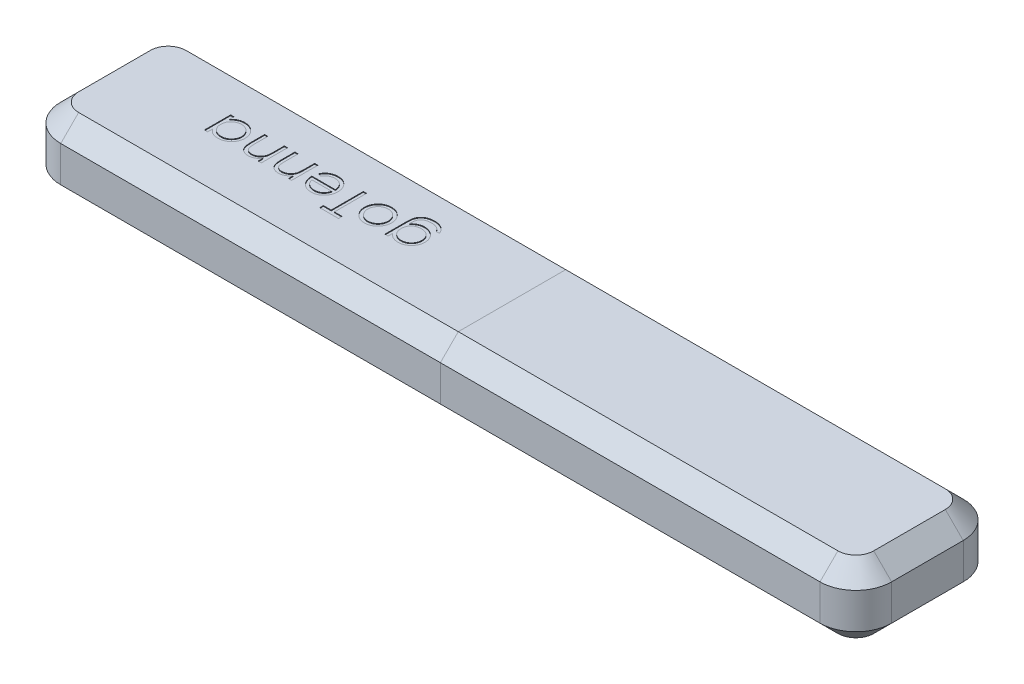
from build123d import *

# Parameters (mm, degrees)
SKETCH1_W           = 25.4
SKETCH1_H           = 12.7
BOSS_EXTRUDE1_DEPTH = 73.66
SKETCH2_W           = 25.4
SKETCH2_H           = 12.7
BOSS_EXTRUDE2_DEPTH = 73.66
FILLET1_R           = 6.35
FILLET2_R           = 6.35
CHAMFER1_SIZE       = 3.175
CHAMFER2_SIZE       = 3.175
CUT_EXTRUDE1_DEPTH  = 0.127


with BuildPart() as part:
    # Sketch1 → Boss-Extrude1 (new body)
    with BuildSketch(Plane(origin=(0, 0, 0), x_dir=(0, 0, -1), z_dir=(1, 0, 0))):
        Rectangle(SKETCH1_W, SKETCH1_H)
    extrude(amount=BOSS_EXTRUDE1_DEPTH)

    # Fillet2
    fillet2_edges = [part.edges().sort_by_distance(p)[0] for p in [
        (73.66, 0, -12.7),
        (73.66, 0, 12.7),
    ]]
    fillet(fillet2_edges, radius=FILLET2_R)

    # Chamfer2
    chamfer2_edges = [part.edges().sort_by_distance(p)[0] for p in [
        (73.66, -6.35, 0),
        (73.66, 6.35, 0),
        (33.655, 6.35, 12.7),
        (33.655, 6.35, -12.7),
        (71.800128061, 6.35, 10.840128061),
        (71.800128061, 6.35, -10.840128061),
        (33.655, -6.35, -12.7),
        (33.655, -6.35, 12.7),
        (71.800128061, -6.35, 10.840128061),
        (71.800128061, -6.35, -10.840128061),
    ]]
    chamfer(chamfer2_edges, length=CHAMFER2_SIZE)


with BuildPart() as body_2:
    # Sketch2 → Boss-Extrude2 (new body)
    with BuildSketch(Plane.ZY):
        Rectangle(SKETCH2_W, SKETCH2_H)
    extrude(amount=BOSS_EXTRUDE2_DEPTH)

    # Fillet1
    fillet1_edges = [body_2.edges().sort_by_distance(p)[0] for p in [
        (-73.66, 0, -12.7),
        (-73.66, 0, 12.7),
    ]]
    fillet(fillet1_edges, radius=FILLET1_R)

    # Chamfer1
    chamfer1_edges = [body_2.edges().sort_by_distance(p)[0] for p in [
        (-73.66, -6.35, 0),
        (-73.66, 6.35, 0),
        (-33.655, -6.35, 12.7),
        (-33.655, -6.35, -12.7),
        (-71.800128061, -6.35, 10.840128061),
        (-71.800128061, -6.35, -10.840128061),
        (-33.655, 6.35, -12.7),
        (-33.655, 6.35, 12.7),
        (-71.800128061, 6.35, 10.840128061),
        (-71.800128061, 6.35, -10.840128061),
    ]]
    chamfer(chamfer1_edges, length=CHAMFER1_SIZE)

    # Sketch3 → Cut-Extrude1 (cut)
    # profile 1 of 7: a face of its own
    with BuildSketch(Plane(origin=(0, 6.35, 0), x_dir=(1, 0, 0), z_dir=(0, 1, 0))):
        with BuildLine():
            Line((-20.904662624, -1.06099568), (-21.474534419, -1.06099568))
            Line((-21.474534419, -1.06099568), (-21.474534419, 2.621546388))
            add(Edge.make_bspline(
                [(-21.474534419, 2.621546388), (-21.474031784, 2.699991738), (-21.473061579, 2.85141016), (-21.466074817, 3.070355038), (-21.451341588, 3.272586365), (-21.434634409, 3.459026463), (-21.410601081, 3.628811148), (-21.381252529, 3.782447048), (-21.348167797, 3.920081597), (-21.319102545, 4.004853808), (-21.30535373, 4.044953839)],
                knots=[0, 0, 0, 0, 1.307562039, 2.523909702, 3.650326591, 4.686913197, 5.643429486, 6.506965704, 7.293745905, 8, 8, 8, 8], degree=3))
            add(Edge.make_bspline(
                [(-21.30535373, 4.044953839), (-21.285055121, 4.097079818), (-21.24506482, 4.199773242), (-21.170134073, 4.345316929), (-21.086351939, 4.482469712), (-20.990347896, 4.609703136), (-20.884435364, 4.728874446), (-20.767298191, 4.838264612), (-20.639222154, 4.937736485), (-20.501354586, 5.028233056), (-20.354676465, 5.10910295), (-20.199990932, 5.179590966), (-20.037685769, 5.237882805), (-19.868478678, 5.285947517), (-19.692295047, 5.324696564), (-19.508571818, 5.350557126), (-19.317923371, 5.367968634), (-19.188303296, 5.369591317), (-19.12254123, 5.370414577)],
                knots=[0, 0, 0, 0, 0.981980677, 1.934600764, 2.870922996, 3.801898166, 4.730277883, 5.66822786, 6.612778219, 7.575390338, 8.562104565, 9.552017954, 10.558022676, 11.588218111, 12.640020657, 13.7238485, 14.84520645, 16, 16, 16, 16], degree=3))
            add(Edge.make_bspline(
                [(-19.12254123, 5.370414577), (-19.026619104, 5.368669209), (-18.83930761, 5.365260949), (-18.565671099, 5.332571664), (-18.306977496, 5.280171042), (-18.064966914, 5.204734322), (-17.841480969, 5.111846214), (-17.637244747, 5.006282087), (-17.455666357, 4.883959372), (-17.292128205, 4.745219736), (-17.14455914, 4.580170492), (-17.00571441, 4.385685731), (-16.872073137, 4.158777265), (-16.793752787, 3.992239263), (-16.752739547, 3.905029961)],
                knots=[0, 0, 0, 0, 1.157891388, 2.261067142, 3.322482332, 4.341146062, 5.316743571, 6.242014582, 7.11254001, 7.955027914, 8.825041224, 9.77858257, 10.836732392, 12, 12, 12, 12], degree=3))
            Line((-16.752739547, 3.905029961), (-17.322611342, 3.905029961))
            add(Edge.make_bspline(
                [(-17.322611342, 3.905029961), (-17.368464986, 3.977770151), (-17.458103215, 4.119968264), (-17.625173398, 4.304266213), (-17.809613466, 4.460323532), (-18.015336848, 4.586946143), (-18.243778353, 4.684424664), (-18.496415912, 4.752132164), (-18.773940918, 4.793094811), (-18.967204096, 4.797992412), (-19.067843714, 4.800542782)],
                knots=[0, 0, 0, 0, 0.997887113, 1.950746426, 2.877762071, 3.798308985, 4.747694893, 5.754452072, 6.830656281, 8, 8, 8, 8], degree=3))
            add(Edge.make_bspline(
                [(-19.067843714, 4.800542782), (-19.167213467, 4.797970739), (-19.358788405, 4.793012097), (-19.634565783, 4.751932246), (-19.886881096, 4.684592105), (-20.112507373, 4.587500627), (-20.309293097, 4.469931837), (-20.480505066, 4.341160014), (-20.618182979, 4.193692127), (-20.711167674, 4.058102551), (-20.768908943, 3.93721438), (-20.805714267, 3.833167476), (-20.835397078, 3.715889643), (-20.860877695, 3.585101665), (-20.881068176, 3.440753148), (-20.894315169, 3.282351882), (-20.903717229, 3.110969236), (-20.904340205, 2.992146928), (-20.904662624, 2.930650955)],
                knots=[0, 0, 0, 0, 1.570812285, 3.028368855, 4.398074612, 5.689726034, 6.898366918, 8.016954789, 9.065347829, 10.075205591, 10.603066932, 11.179971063, 11.817519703, 12.514501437, 13.286417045, 14.121160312, 15.027614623, 16, 16, 16, 16], degree=3))
            Line((-20.904662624, 2.930650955), (-20.904662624, 2.690236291))
            add(Edge.make_bspline(
                [(-20.904662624, 2.690236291), (-20.846801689, 2.759045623), (-20.732097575, 2.895453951), (-20.534540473, 3.074517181), (-20.317396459, 3.226871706), (-20.083734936, 3.353600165), (-19.837038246, 3.454005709), (-19.581668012, 3.526758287), (-19.318341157, 3.571884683), (-19.140104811, 3.576869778), (-19.05003522, 3.579388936)],
                knots=[0, 0, 0, 0, 1.012670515, 2.007528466, 2.995541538, 3.996581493, 4.997861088, 5.991949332, 6.98525577, 8, 8, 8, 8], degree=3))
            add(Edge.make_bspline(
                [(-19.05003522, 3.579388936), (-18.997012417, 3.578269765), (-18.891633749, 3.5760455), (-18.73463675, 3.562515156), (-18.580665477, 3.536167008), (-18.428739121, 3.502428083), (-18.279919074, 3.457201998), (-18.132422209, 3.404121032), (-17.988390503, 3.338923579), (-17.847089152, 3.265520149), (-17.71184219, 3.183046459), (-17.583076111, 3.093939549), (-17.461578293, 2.998392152), (-17.348491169, 2.895524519), (-17.243909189, 2.785504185), (-17.146654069, 2.669369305), (-17.057605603, 2.546204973), (-16.977917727, 2.41596361), (-16.905114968, 2.281820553), (-16.842782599, 2.143133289), (-16.791038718, 2.000779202), (-16.745436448, 1.856537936), (-16.713144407, 1.707779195), (-16.688452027, 1.556266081), (-16.674598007, 1.401074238), (-16.672423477, 1.296534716), (-16.671329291, 1.243932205)],
                knots=[0, 0, 0, 0, 1.028752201, 2.044564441, 3.053391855, 4.057142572, 5.061701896, 6.068783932, 7.096088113, 8.1262863, 9.156123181, 10.166960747, 11.162589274, 12.152492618, 13.129945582, 14.10521553, 15.089188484, 16.075359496, 17.065365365, 18.04840954, 19.021769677, 20.00271226, 20.980580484, 21.971849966, 22.979469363, 24, 24, 24, 24], degree=3))
            add(Edge.make_bspline(
                [(-16.671329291, 1.243932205), (-16.672270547, 1.19131205), (-16.674149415, 1.086275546), (-16.690398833, 0.930469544), (-16.713527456, 0.77673218), (-16.750325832, 0.626731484), (-16.793989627, 0.478301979), (-16.850619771, 0.333860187), (-16.91586492, 0.191494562), (-16.990437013, 0.052453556), (-17.07391249, -0.081983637), (-17.165796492, -0.209063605), (-17.264168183, -0.329843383), (-17.371007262, -0.442773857), (-17.485682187, -0.548701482), (-17.608526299, -0.646696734), (-17.73817327, -0.738530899), (-17.87506715, -0.82218844), (-18.017084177, -0.896179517), (-18.160619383, -0.963693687), (-18.307573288, -1.017277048), (-18.455206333, -1.064490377), (-18.606118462, -1.09793709), (-18.758459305, -1.1237403), (-18.912750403, -1.139460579), (-19.016079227, -1.141422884), (-19.067843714, -1.142405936)],
                knots=[0, 0, 0, 0, 1.008914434, 2.013921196, 3.001938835, 3.98818112, 4.973517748, 5.967241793, 6.960633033, 7.975722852, 8.991170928, 9.993245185, 10.981396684, 11.976616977, 12.972235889, 13.973022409, 14.988340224, 16.01763096, 17.047082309, 18.058647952, 19.057085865, 20.044802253, 21.029198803, 22.0185208, 23.007341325, 24, 24, 24, 24], degree=3))
            add(Edge.make_bspline(
                [(-19.067843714, -1.142405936), (-19.153214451, -1.139982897), (-19.321375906, -1.135210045), (-19.569343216, -1.096597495), (-19.808879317, -1.03641558), (-20.041211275, -0.948929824), (-20.267757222, -0.830537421), (-20.487153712, -0.672587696), (-20.703156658, -0.478200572), (-20.835783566, -0.327633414), (-20.904662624, -0.249437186)],
                knots=[0, 0, 0, 0, 0.967343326, 1.905452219, 2.838102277, 3.762990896, 4.713322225, 5.726933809, 6.819495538, 8, 8, 8, 8], degree=3))
            Line((-20.904662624, -0.249437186), (-20.904662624, -1.06099568))
        make_face()
        with BuildLine():
            add(Edge.make_bspline(
                [(-19.113636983, -0.572534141), (-19.030310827, -0.569691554), (-18.865342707, -0.564063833), (-18.623442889, -0.516345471), (-18.390449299, -0.440819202), (-18.168671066, -0.335688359), (-17.963173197, -0.202847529), (-17.779393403, -0.0447084), (-17.618861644, 0.13596092), (-17.484712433, 0.338545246), (-17.376539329, 0.556441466), (-17.298924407, 0.785727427), (-17.249347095, 1.023443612), (-17.243933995, 1.185175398), (-17.241201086, 1.266828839)],
                knots=[0, 0, 0, 0, 1.026297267, 2.031850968, 3.02682269, 4.039104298, 5.04807494, 6.033889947, 7.01870694, 8.017446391, 9.02017099, 10.008531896, 10.994568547, 12, 12, 12, 12], degree=3))
            add(Edge.make_bspline(
                [(-17.241201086, 1.266828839), (-17.242522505, 1.328391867), (-17.24512135, 1.44946834), (-17.269952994, 1.627178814), (-17.310532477, 1.796721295), (-17.366753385, 1.957821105), (-17.438126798, 2.111115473), (-17.528273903, 2.254812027), (-17.632626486, 2.391497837), (-17.752224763, 2.518222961), (-17.883835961, 2.633804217), (-18.026489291, 2.73483485), (-18.179411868, 2.818601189), (-18.34015796, 2.889923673), (-18.512131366, 2.942391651), (-18.692753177, 2.982355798), (-18.883234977, 3.005237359), (-19.013086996, 3.008071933), (-19.079292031, 3.009517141)],
                knots=[0, 0, 0, 0, 1.039874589, 2.045129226, 3.025325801, 3.981633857, 4.924015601, 5.876477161, 6.842427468, 7.825840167, 8.816042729, 9.798123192, 10.773172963, 11.758281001, 12.764505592, 13.805958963, 14.88136847, 16, 16, 16, 16], degree=3))
            add(Edge.make_bspline(
                [(-19.079292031, 3.009517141), (-19.14635485, 3.008124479), (-19.277495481, 3.005401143), (-19.469031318, 2.981990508), (-19.650519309, 2.944213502), (-19.821792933, 2.890577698), (-19.983499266, 2.822139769), (-20.133820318, 2.735531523), (-20.275984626, 2.636900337), (-20.405433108, 2.52184749), (-20.522544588, 2.395075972), (-20.624393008, 2.257035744), (-20.711864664, 2.110390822), (-20.781483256, 1.953271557), (-20.838910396, 1.787754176), (-20.875114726, 1.611047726), (-20.901080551, 1.425753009), (-20.903450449, 1.298727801), (-20.904662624, 1.233755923)],
                knots=[0, 0, 0, 0, 1.121992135, 2.194043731, 3.223932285, 4.220423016, 5.193184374, 6.156086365, 7.118779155, 8.084057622, 9.048292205, 10.002025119, 10.950065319, 11.899697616, 12.87359713, 13.875731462, 14.913461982, 16, 16, 16, 16], degree=3))
            add(Edge.make_bspline(
                [(-20.904662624, 1.233755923), (-20.902227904, 1.149179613), (-20.897471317, 0.983947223), (-20.852724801, 0.743154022), (-20.780138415, 0.516515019), (-20.679400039, 0.304610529), (-20.552582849, 0.110390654), (-20.398339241, -0.061221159), (-20.223500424, -0.214977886), (-20.023767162, -0.341343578), (-19.809691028, -0.444741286), (-19.584806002, -0.518795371), (-19.351570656, -0.56340556), (-19.193544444, -0.569468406), (-19.113636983, -0.572534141)],
                knots=[0, 0, 0, 0, 1.070694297, 2.091760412, 3.090724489, 4.078342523, 5.055782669, 6.018541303, 6.993409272, 7.996294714, 9.003086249, 9.99860646, 10.987976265, 12, 12, 12, 12], degree=3))
        make_face(mode=Mode.SUBTRACT)
    # profile 2 of 7: a face of its own
    with BuildSketch(Plane(origin=(0, 6.35, 0), x_dir=(1, 0, 0), z_dir=(0, 1, 0))):
        with BuildLine():
            add(Edge.make_bspline(
                [(-25.018424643, -1.142405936), (-25.105496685, -1.140557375), (-25.276223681, -1.136932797), (-25.526215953, -1.098002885), (-25.764601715, -1.03896816), (-25.992403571, -0.955869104), (-26.20773714, -0.846839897), (-26.412524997, -0.714991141), (-26.606356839, -0.559430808), (-26.722508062, -0.439028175), (-26.781465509, -0.377912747)],
                knots=[0, 0, 0, 0, 1.054042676, 2.066720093, 3.05716247, 4.025731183, 4.997454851, 5.974904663, 6.97207755, 8, 8, 8, 8], degree=3))
            add(Edge.make_bspline(
                [(-26.781465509, -0.377912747), (-26.832232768, -0.319467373), (-26.932784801, -0.203707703), (-27.061718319, -0.016009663), (-27.172791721, 0.178373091), (-27.26180595, 0.382021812), (-27.331991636, 0.593158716), (-27.381822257, 0.812509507), (-27.411462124, 1.039589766), (-27.415458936, 1.193811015), (-27.417483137, 1.27191698)],
                knots=[0, 0, 0, 0, 1.025258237, 2.030674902, 3.01204498, 3.988269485, 4.97094183, 5.956517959, 6.965070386, 8, 8, 8, 8], degree=3))
            add(Edge.make_bspline(
                [(-27.417483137, 1.27191698), (-27.415702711, 1.350475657), (-27.412184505, 1.505711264), (-27.378903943, 1.734346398), (-27.327140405, 1.956042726), (-27.253059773, 2.169872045), (-27.158067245, 2.376488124), (-27.042151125, 2.574987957), (-26.904498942, 2.765765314), (-26.748460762, 2.947192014), (-26.576018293, 3.114427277), (-26.388904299, 3.260095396), (-26.190660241, 3.385419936), (-25.978579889, 3.484962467), (-25.755682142, 3.56520068), (-25.520549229, 3.620530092), (-25.273390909, 3.654282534), (-25.104608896, 3.658596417), (-25.018424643, 3.660799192)],
                knots=[0, 0, 0, 0, 0.998669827, 1.973418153, 2.932281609, 3.89081133, 4.846438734, 5.82045571, 6.809776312, 7.834649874, 8.860672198, 9.859676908, 10.845817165, 11.837296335, 12.833502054, 13.853824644, 14.904110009, 16, 16, 16, 16], degree=3))
            add(Edge.make_bspline(
                [(-25.018424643, 3.660799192), (-24.931822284, 3.658578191), (-24.762207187, 3.65422825), (-24.514118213, 3.620781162), (-24.277995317, 3.564609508), (-24.054043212, 3.485955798), (-23.84196372, 3.384602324), (-23.642987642, 3.260583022), (-23.45578539, 3.114353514), (-23.283288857, 2.947212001), (-23.127265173, 2.765760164), (-22.989609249, 2.574989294), (-22.873694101, 2.376487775), (-22.778701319, 2.169872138), (-22.704620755, 1.956042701), (-22.652857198, 1.734346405), (-22.619576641, 1.505711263), (-22.616058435, 1.350475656), (-22.614278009, 1.27191698)],
                knots=[0, 0, 0, 0, 1.099861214, 2.154133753, 3.1731438, 4.178222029, 5.163564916, 6.153006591, 7.15072618, 8.175428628, 9.198983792, 10.187031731, 11.15979573, 12.114193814, 13.071490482, 14.029120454, 15.002614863, 16, 16, 16, 16], degree=3))
            add(Edge.make_bspline(
                [(-22.614278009, 1.27191698), (-22.616311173, 1.1942338), (-22.620336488, 1.040434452), (-22.650016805, 0.813806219), (-22.69930523, 0.595126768), (-22.77046389, 0.385142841), (-22.859312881, 0.181983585), (-22.969268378, -0.013111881), (-23.099449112, -0.19998976), (-23.199610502, -0.315595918), (-23.250295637, -0.374096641)],
                knots=[0, 0, 0, 0, 1.031377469, 2.041950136, 3.029500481, 4.003457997, 4.981637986, 5.969878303, 6.97268806, 8, 8, 8, 8], degree=3))
            add(Edge.make_bspline(
                [(-23.250295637, -0.374096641), (-23.309169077, -0.435731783), (-23.424954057, -0.556948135), (-23.619680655, -0.71220154), (-23.823587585, -0.845827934), (-24.04031013, -0.95480227), (-24.268745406, -1.038817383), (-24.508902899, -1.098278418), (-24.759805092, -1.136760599), (-24.931359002, -1.140505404), (-25.018424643, -1.142405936)],
                knots=[0, 0, 0, 0, 1.027951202, 2.021646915, 2.998468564, 3.9668038, 4.943370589, 5.93035926, 6.949632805, 8, 8, 8, 8], degree=3))
        make_face()
        with BuildLine():
            add(Edge.make_bspline(
                [(-25.015880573, -0.572534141), (-24.954308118, -0.570784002), (-24.832752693, -0.567328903), (-24.653827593, -0.541052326), (-24.481582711, -0.499413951), (-24.315669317, -0.44027948), (-24.156728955, -0.363829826), (-24.004587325, -0.27045972), (-23.859650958, -0.159672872), (-23.723041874, -0.033667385), (-23.596171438, 0.103184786), (-23.486635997, 0.250385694), (-23.392797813, 0.403845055), (-23.316124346, 0.564430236), (-23.257300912, 0.732582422), (-23.215622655, 0.907339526), (-23.18929621, 1.089221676), (-23.185883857, 1.212889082), (-23.184149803, 1.275733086)],
                knots=[0, 0, 0, 0, 1.021608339, 2.016844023, 2.99486249, 3.958675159, 4.934437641, 5.916902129, 6.916234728, 7.957219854, 8.998204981, 10.008773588, 10.997243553, 11.979355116, 12.956436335, 13.948132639, 14.957303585, 16, 16, 16, 16], degree=3))
            add(Edge.make_bspline(
                [(-23.184149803, 1.275733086), (-23.187057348, 1.356929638), (-23.19282828, 1.518089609), (-23.239995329, 1.7553656), (-23.318341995, 1.983585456), (-23.426376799, 2.200001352), (-23.559424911, 2.400584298), (-23.714997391, 2.580949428), (-23.895245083, 2.734141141), (-24.094030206, 2.86297795), (-24.308535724, 2.964436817), (-24.535165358, 3.037196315), (-24.771855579, 3.083857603), (-24.933827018, 3.088550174), (-25.015880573, 3.090927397)],
                knots=[0, 0, 0, 0, 1.016977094, 2.018509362, 3.018404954, 4.033172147, 5.041280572, 6.028085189, 7.007940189, 7.995502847, 8.989109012, 9.972200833, 10.97273166, 12, 12, 12, 12], degree=3))
            add(Edge.make_bspline(
                [(-25.015880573, 3.090927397), (-25.097938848, 3.088563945), (-25.259919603, 3.083898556), (-25.496939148, 3.036959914), (-25.724189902, 2.964753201), (-25.93891845, 2.862863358), (-26.1377941, 2.73462811), (-26.316754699, 2.580076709), (-26.473666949, 2.401058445), (-26.606846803, 2.200267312), (-26.713140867, 1.983249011), (-26.791855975, 1.755407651), (-26.838909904, 1.5180789), (-26.844696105, 1.35692605), (-26.847611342, 1.275733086)],
                knots=[0, 0, 0, 0, 1.027082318, 2.027431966, 3.015401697, 4.008827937, 4.996211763, 5.971861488, 6.96198607, 7.969911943, 8.982141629, 9.981856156, 10.983207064, 12, 12, 12, 12], degree=3))
            add(Edge.make_bspline(
                [(-26.847611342, 1.275733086), (-26.845890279, 1.21288403), (-26.84250349, 1.089206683), (-26.815991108, 0.907396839), (-26.77496705, 0.732234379), (-26.713607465, 0.565108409), (-26.639605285, 0.403063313), (-26.543492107, 0.250845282), (-26.434466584, 0.10309141), (-26.307363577, -0.033584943), (-26.170769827, -0.160133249), (-26.024744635, -0.270056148), (-25.872532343, -0.363883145), (-25.713541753, -0.440288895), (-25.548003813, -0.499186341), (-25.376281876, -0.541233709), (-25.198149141, -0.567233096), (-25.077025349, -0.570755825), (-25.015880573, -0.572534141)],
                knots=[0, 0, 0, 0, 1.043037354, 2.052538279, 3.044558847, 4.0243144, 5.003741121, 5.996211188, 7.007110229, 8.048435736, 9.089761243, 10.095031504, 11.077817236, 12.053898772, 13.018026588, 13.989527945, 14.985089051, 16, 16, 16, 16], degree=3))
        make_face(mode=Mode.SUBTRACT)
    # profile 3 of 7: a face of its own
    with BuildSketch(Plane(origin=(0, 6.35, 0), x_dir=(1, 0, 0), z_dir=(0, 1, 0))):
        Polygon((-27.987354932, -2.119329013), (-27.987354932, -2.770611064), (-31.325175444, -2.770611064), (-31.325175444, -2.119329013), (-29.941201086, -2.119329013), (-29.941201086, 3.579388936), (-29.371329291, 3.579388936), (-29.371329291, -2.119329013), align=None)
    # profile 4 of 7: a face of its own
    with BuildSketch(Plane(origin=(0, 6.35, 0), x_dir=(1, 0, 0), z_dir=(0, 1, 0))):
        with BuildLine():
            Line((-36.110572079, 2.11400432), (-36.616842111, 2.379859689))
            add(Edge.make_bspline(
                [(-36.616842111, 2.379859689), (-36.576471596, 2.451398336), (-36.497926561, 2.590584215), (-36.363500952, 2.781915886), (-36.221122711, 2.95242606), (-36.067962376, 3.101314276), (-35.905941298, 3.232078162), (-35.732646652, 3.344123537), (-35.550961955, 3.441405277), (-35.35825192, 3.520695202), (-35.154700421, 3.583105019), (-34.93905346, 3.629175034), (-34.710313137, 3.655896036), (-34.553671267, 3.659138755), (-34.473462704, 3.660799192)],
                knots=[0, 0, 0, 0, 1.120547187, 2.180141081, 3.186367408, 4.148075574, 5.090720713, 6.023293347, 6.960451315, 7.899733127, 8.862572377, 9.862522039, 10.90550313, 12, 12, 12, 12], degree=3))
            add(Edge.make_bspline(
                [(-34.473462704, 3.660799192), (-34.384305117, 3.658717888), (-34.210384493, 3.654657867), (-33.957219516, 3.619655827), (-33.718859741, 3.562555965), (-33.495318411, 3.482789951), (-33.287143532, 3.378600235), (-33.093919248, 3.251674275), (-32.914637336, 3.102660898), (-32.754917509, 2.930281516), (-32.611216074, 2.745773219), (-32.484099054, 2.553640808), (-32.379056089, 2.353965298), (-32.289397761, 2.149778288), (-32.223058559, 1.938362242), (-32.173530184, 1.721579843), (-32.145779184, 1.498637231), (-32.141456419, 1.347886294), (-32.139278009, 1.27191698)],
                knots=[0, 0, 0, 0, 1.145213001, 2.233978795, 3.276616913, 4.289988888, 5.2768102, 6.260573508, 7.254647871, 8.264498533, 9.273731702, 10.25749501, 11.220258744, 12.169609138, 13.119022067, 14.062790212, 15.023763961, 16, 16, 16, 16], degree=3))
            add(Edge.make_bspline(
                [(-32.139278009, 1.27191698), (-32.141199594, 1.200624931), (-32.145007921, 1.059333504), (-32.16901235, 0.850208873), (-32.211554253, 0.646957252), (-32.269931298, 0.449409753), (-32.34531713, 0.257897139), (-32.437541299, 0.072302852), (-32.54674747, -0.107175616), (-32.631062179, -0.22039273), (-32.673532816, -0.277421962)],
                knots=[0, 0, 0, 0, 1.024358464, 2.0301432, 3.019427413, 4.004406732, 4.986367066, 5.972626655, 6.978780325, 8, 8, 8, 8], degree=3))
            add(Edge.make_bspline(
                [(-32.673532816, -0.277421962), (-32.730960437, -0.346240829), (-32.843812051, -0.481477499), (-33.036664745, -0.657553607), (-33.242676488, -0.808171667), (-33.463919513, -0.931046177), (-33.700021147, -1.025556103), (-33.949763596, -1.092779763), (-34.213837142, -1.134609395), (-34.394862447, -1.139767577), (-34.487455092, -1.142405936)],
                knots=[0, 0, 0, 0, 1.030811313, 2.025658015, 2.997072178, 3.962767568, 4.930766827, 5.917075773, 6.934604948, 8, 8, 8, 8], degree=3))
            add(Edge.make_bspline(
                [(-34.487455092, -1.142405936), (-34.582615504, -1.139961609), (-34.769298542, -1.135166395), (-35.041422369, -1.090313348), (-35.299417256, -1.020048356), (-35.541154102, -0.917675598), (-35.770357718, -0.790777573), (-35.981753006, -0.63038441), (-36.181142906, -0.444734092), (-36.297079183, -0.301812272), (-36.356074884, -0.229084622)],
                knots=[0, 0, 0, 0, 1.056389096, 2.072394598, 3.055233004, 4.020130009, 4.981825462, 5.957811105, 6.960805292, 8, 8, 8, 8], degree=3))
            add(Edge.make_bspline(
                [(-36.356074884, -0.229084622), (-36.396219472, -0.174286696), (-36.476241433, -0.065055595), (-36.576475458, 0.113054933), (-36.663483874, 0.299401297), (-36.733030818, 0.496995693), (-36.789345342, 0.703496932), (-36.830088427, 0.920381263), (-36.853981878, 1.147584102), (-36.858678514, 1.302390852), (-36.86107288, 1.381312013)],
                knots=[0, 0, 0, 0, 0.94817472, 1.890038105, 2.849395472, 3.817997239, 4.812318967, 5.836947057, 6.897266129, 8, 8, 8, 8], degree=3))
            Line((-36.86107288, 1.381312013), (-32.709149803, 1.381312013))
            add(Edge.make_bspline(
                [(-32.709149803, 1.381312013), (-32.711945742, 1.442453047), (-32.717443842, 1.562684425), (-32.743015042, 1.738634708), (-32.783517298, 1.906162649), (-32.839816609, 2.064554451), (-32.910410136, 2.214330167), (-32.99416735, 2.356522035), (-33.094702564, 2.4889706), (-33.206652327, 2.61339223), (-33.331323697, 2.724153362), (-33.462435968, 2.823366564), (-33.601710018, 2.90606105), (-33.747741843, 2.974194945), (-33.901288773, 3.026635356), (-34.062134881, 3.062747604), (-34.229779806, 3.086872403), (-34.344052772, 3.089559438), (-34.40222873, 3.090927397)],
                knots=[0, 0, 0, 0, 1.094405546, 2.152104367, 3.174987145, 4.173015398, 5.153654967, 6.133208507, 7.119289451, 8.123438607, 9.122504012, 10.097966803, 11.060604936, 12.014205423, 12.976096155, 13.956823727, 14.959826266, 16, 16, 16, 16], degree=3))
            add(Edge.make_bspline(
                [(-34.40222873, 3.090927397), (-34.459112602, 3.089840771), (-34.571981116, 3.087684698), (-34.740412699, 3.066102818), (-34.906503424, 3.032465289), (-35.068099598, 2.983657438), (-35.222613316, 2.925934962), (-35.36690749, 2.85844383), (-35.499627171, 2.782372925), (-35.623434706, 2.694579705), (-35.742869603, 2.58795136), (-35.861728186, 2.454638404), (-35.988032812, 2.296029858), (-36.068188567, 2.176962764), (-36.110572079, 2.11400432)],
                knots=[0, 0, 0, 0, 0.991026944, 1.966387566, 2.954903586, 3.941705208, 4.905318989, 5.827751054, 6.715113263, 7.568237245, 8.468614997, 9.499196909, 10.677664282, 12, 12, 12, 12], degree=3))
        make_face()
        with BuildLine():
            add(Edge.make_bspline(
                [(-36.291201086, 0.811440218), (-36.270462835, 0.735796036), (-36.230652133, 0.590583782), (-36.14533272, 0.390040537), (-36.053701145, 0.209758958), (-35.941175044, 0.054297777), (-35.813829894, -0.083036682), (-35.66628268, -0.202328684), (-35.503407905, -0.311750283), (-35.322244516, -0.40296685), (-35.129794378, -0.477898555), (-34.930053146, -0.533003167), (-34.724682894, -0.565393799), (-34.586361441, -0.570142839), (-34.516711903, -0.572534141)],
                knots=[0, 0, 0, 0, 1.154958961, 2.217145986, 3.207012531, 4.129872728, 5.036522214, 5.960144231, 6.920619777, 7.92424629, 8.943461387, 9.961007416, 10.973298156, 12, 12, 12, 12], degree=3))
            add(Edge.make_bspline(
                [(-34.516711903, -0.572534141), (-34.459832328, -0.57143259), (-34.347393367, -0.569255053), (-34.181786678, -0.548326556), (-34.022045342, -0.514250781), (-33.868935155, -0.46549585), (-33.722110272, -0.404189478), (-33.58089704, -0.330407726), (-33.446995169, -0.240634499), (-33.36328755, -0.172114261), (-33.320998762, -0.137498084)],
                knots=[0, 0, 0, 0, 1.04879286, 2.073242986, 3.073461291, 4.057960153, 5.032623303, 6.005244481, 6.992256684, 8, 8, 8, 8], degree=3))
            add(Edge.make_bspline(
                [(-33.320998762, -0.137498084), (-33.290707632, -0.110115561), (-33.229405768, -0.054700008), (-33.14758205, 0.040829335), (-33.068654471, 0.143899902), (-32.998515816, 0.25901082), (-32.931859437, 0.382823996), (-32.871118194, 0.516242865), (-32.815889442, 0.659830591), (-32.784886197, 0.759936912), (-32.768935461, 0.811440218)],
                knots=[0, 0, 0, 0, 0.879905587, 1.780714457, 2.708106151, 3.677566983, 4.684151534, 5.740052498, 6.837288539, 8, 8, 8, 8], degree=3))
            Line((-32.768935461, 0.811440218), (-36.291201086, 0.811440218))
        make_face(mode=Mode.SUBTRACT)
    # profile 5 of 7: a face of its own
    with BuildSketch(Plane(origin=(0, 6.35, 0), x_dir=(1, 0, 0), z_dir=(0, 1, 0))):
        with BuildLine():
            Line((-38.00081647, -1.06099568), (-38.570688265, -1.06099568))
            Line((-38.570688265, -1.06099568), (-38.570688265, -0.223996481))
            add(Edge.make_bspline(
                [(-38.570688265, -0.223996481), (-38.631430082, -0.300024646), (-38.74911656, -0.447328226), (-38.9471216, -0.639410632), (-39.153581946, -0.800598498), (-39.37185084, -0.927510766), (-39.599682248, -1.02349483), (-39.836429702, -1.092710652), (-40.083374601, -1.134237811), (-40.251313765, -1.139661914), (-40.336273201, -1.142405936)],
                knots=[0, 0, 0, 0, 1.127869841, 2.185233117, 3.191641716, 4.159226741, 5.10472073, 6.052603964, 7.014823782, 8, 8, 8, 8], degree=3))
            add(Edge.make_bspline(
                [(-40.336273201, -1.142405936), (-40.422185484, -1.139418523), (-40.590420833, -1.133568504), (-40.834488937, -1.082022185), (-41.064036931, -1.000449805), (-41.275995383, -0.885803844), (-41.467102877, -0.743463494), (-41.632825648, -0.576497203), (-41.772190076, -0.38691648), (-41.865209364, -0.209464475), (-41.92537325, -0.051841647), (-41.964910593, 0.082977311), (-41.996897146, 0.233242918), (-42.025558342, 0.398583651), (-42.044678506, 0.579663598), (-42.059834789, 0.776050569), (-42.070675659, 0.98771056), (-42.071106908, 1.134098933), (-42.071329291, 1.209587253)],
                knots=[0, 0, 0, 0, 1.235764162, 2.419900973, 3.574701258, 4.732869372, 5.875730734, 6.993815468, 8.107424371, 9.251605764, 9.866123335, 10.534503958, 11.272175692, 12.077112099, 12.949509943, 13.89253218, 14.913238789, 16, 16, 16, 16], degree=3))
            Line((-42.071329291, 1.209587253), (-42.071329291, 3.579388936))
            Line((-42.071329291, 3.579388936), (-41.501457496, 3.579388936))
            Line((-41.501457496, 3.579388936), (-41.501457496, 1.396576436))
            add(Edge.make_bspline(
                [(-41.501457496, 1.396576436), (-41.501108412, 1.33339848), (-41.500440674, 1.212549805), (-41.498307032, 1.039524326), (-41.49328454, 0.883032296), (-41.485936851, 0.742623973), (-41.47565194, 0.618813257), (-41.464641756, 0.510973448), (-41.451288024, 0.420059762), (-41.43938012, 0.365331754), (-41.434039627, 0.340787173)],
                knots=[0, 0, 0, 0, 1.430803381, 2.736883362, 3.918614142, 4.976458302, 5.92063272, 6.731858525, 7.431260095, 8, 8, 8, 8], degree=3))
            add(Edge.make_bspline(
                [(-41.434039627, 0.340787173), (-41.414857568, 0.268687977), (-41.378036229, 0.130288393), (-41.285199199, -0.057118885), (-41.170685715, -0.217966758), (-41.028806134, -0.348947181), (-40.863370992, -0.450912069), (-40.674105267, -0.521606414), (-40.462967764, -0.565836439), (-40.314459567, -0.570239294), (-40.237054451, -0.572534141)],
                knots=[0, 0, 0, 0, 1.084232, 2.08126119, 3.027460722, 3.945137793, 4.874029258, 5.839697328, 6.874011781, 8, 8, 8, 8], degree=3))
            add(Edge.make_bspline(
                [(-40.237054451, -0.572534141), (-40.191207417, -0.571683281), (-40.100477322, -0.56999945), (-39.966009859, -0.552666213), (-39.835165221, -0.525290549), (-39.708293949, -0.484854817), (-39.585139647, -0.435690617), (-39.465192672, -0.375363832), (-39.350129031, -0.30239347), (-39.238330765, -0.220374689), (-39.134419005, -0.129036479), (-39.036352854, -0.034051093), (-38.950189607, 0.06855874), (-38.871977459, 0.17516508), (-38.804544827, 0.287909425), (-38.745660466, 0.405586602), (-38.695704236, 0.528382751), (-38.670879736, 0.613608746), (-38.658458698, 0.656251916)],
                knots=[0, 0, 0, 0, 1.023939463, 2.026349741, 3.024227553, 4.007104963, 4.997624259, 5.984875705, 7.002218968, 8.038748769, 9.079772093, 10.091408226, 11.086177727, 12.069739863, 13.043026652, 14.017557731, 15.008077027, 16, 16, 16, 16], degree=3))
            add(Edge.make_bspline(
                [(-38.658458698, 0.656251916), (-38.65131105, 0.687557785), (-38.635750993, 0.755709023), (-38.618944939, 0.867549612), (-38.603691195, 0.996926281), (-38.590924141, 1.143688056), (-38.583112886, 1.308348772), (-38.574595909, 1.490205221), (-38.571495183, 1.68998255), (-38.57096477, 1.829068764), (-38.570688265, 1.901574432)],
                knots=[0, 0, 0, 0, 0.615963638, 1.340920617, 2.168419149, 3.115676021, 4.16674242, 5.331190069, 6.6087489, 8, 8, 8, 8], degree=3))
            Line((-38.570688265, 1.901574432), (-38.570688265, 3.579388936))
            Line((-38.570688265, 3.579388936), (-38.00081647, 3.579388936))
            Line((-38.00081647, 3.579388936), (-38.00081647, -1.06099568))
        make_face()
    # profile 6 of 7: a face of its own
    with BuildSketch(Plane(origin=(0, 6.35, 0), x_dir=(1, 0, 0), z_dir=(0, 1, 0))):
        with BuildLine():
            Line((-43.373893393, -1.06099568), (-43.943765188, -1.06099568))
            Line((-43.943765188, -1.06099568), (-43.943765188, -0.223996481))
            add(Edge.make_bspline(
                [(-43.943765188, -0.223996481), (-44.004507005, -0.300024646), (-44.122193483, -0.447328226), (-44.320198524, -0.639410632), (-44.526658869, -0.800598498), (-44.744927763, -0.927510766), (-44.972759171, -1.02349483), (-45.209506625, -1.092710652), (-45.456451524, -1.134237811), (-45.624390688, -1.139661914), (-45.709350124, -1.142405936)],
                knots=[0, 0, 0, 0, 1.127869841, 2.185233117, 3.191641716, 4.159226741, 5.10472073, 6.052603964, 7.014823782, 8, 8, 8, 8], degree=3))
            add(Edge.make_bspline(
                [(-45.709350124, -1.142405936), (-45.795262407, -1.139418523), (-45.963497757, -1.133568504), (-46.20756586, -1.082022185), (-46.437113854, -1.000449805), (-46.649072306, -0.885803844), (-46.8401798, -0.743463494), (-47.005902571, -0.576497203), (-47.145266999, -0.38691648), (-47.238286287, -0.209464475), (-47.298450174, -0.051841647), (-47.337987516, 0.082977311), (-47.369974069, 0.233242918), (-47.398635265, 0.398583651), (-47.417755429, 0.579663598), (-47.432911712, 0.776050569), (-47.443752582, 0.98771056), (-47.444183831, 1.134098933), (-47.444406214, 1.209587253)],
                knots=[0, 0, 0, 0, 1.235764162, 2.419900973, 3.574701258, 4.732869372, 5.875730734, 6.993815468, 8.107424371, 9.251605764, 9.866123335, 10.534503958, 11.272175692, 12.077112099, 12.949509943, 13.89253218, 14.913238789, 16, 16, 16, 16], degree=3))
            Line((-47.444406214, 1.209587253), (-47.444406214, 3.579388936))
            Line((-47.444406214, 3.579388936), (-46.874534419, 3.579388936))
            Line((-46.874534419, 3.579388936), (-46.874534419, 1.396576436))
            add(Edge.make_bspline(
                [(-46.874534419, 1.396576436), (-46.874185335, 1.33339848), (-46.873517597, 1.212549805), (-46.871383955, 1.039524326), (-46.866361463, 0.883032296), (-46.859013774, 0.742623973), (-46.848728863, 0.618813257), (-46.837718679, 0.510973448), (-46.824364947, 0.420059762), (-46.812457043, 0.365331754), (-46.80711655, 0.340787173)],
                knots=[0, 0, 0, 0, 1.430803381, 2.736883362, 3.918614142, 4.976458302, 5.92063272, 6.731858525, 7.431260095, 8, 8, 8, 8], degree=3))
            add(Edge.make_bspline(
                [(-46.80711655, 0.340787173), (-46.787934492, 0.268687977), (-46.751113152, 0.130288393), (-46.658276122, -0.057118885), (-46.543762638, -0.217966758), (-46.401883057, -0.348947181), (-46.236447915, -0.450912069), (-46.04718219, -0.521606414), (-45.836044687, -0.565836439), (-45.68753649, -0.570239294), (-45.610131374, -0.572534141)],
                knots=[0, 0, 0, 0, 1.084232, 2.08126119, 3.027460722, 3.945137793, 4.874029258, 5.839697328, 6.874011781, 8, 8, 8, 8], degree=3))
            add(Edge.make_bspline(
                [(-45.610131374, -0.572534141), (-45.56428434, -0.571683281), (-45.473554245, -0.56999945), (-45.339086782, -0.552666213), (-45.208242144, -0.525290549), (-45.081370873, -0.484854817), (-44.95821657, -0.435690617), (-44.838269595, -0.375363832), (-44.723205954, -0.30239347), (-44.611407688, -0.220374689), (-44.507495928, -0.129036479), (-44.409429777, -0.034051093), (-44.323266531, 0.06855874), (-44.245054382, 0.17516508), (-44.17762175, 0.287909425), (-44.118737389, 0.405586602), (-44.068781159, 0.528382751), (-44.043956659, 0.613608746), (-44.031535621, 0.656251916)],
                knots=[0, 0, 0, 0, 1.023939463, 2.026349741, 3.024227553, 4.007104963, 4.997624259, 5.984875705, 7.002218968, 8.038748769, 9.079772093, 10.091408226, 11.086177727, 12.069739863, 13.043026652, 14.017557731, 15.008077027, 16, 16, 16, 16], degree=3))
            add(Edge.make_bspline(
                [(-44.031535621, 0.656251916), (-44.024387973, 0.687557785), (-44.008827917, 0.755709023), (-43.992021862, 0.867549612), (-43.976768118, 0.996926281), (-43.964001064, 1.143688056), (-43.956189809, 1.308348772), (-43.947672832, 1.490205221), (-43.944572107, 1.68998255), (-43.944041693, 1.829068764), (-43.943765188, 1.901574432)],
                knots=[0, 0, 0, 0, 0.615963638, 1.340920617, 2.168419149, 3.115676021, 4.16674242, 5.331190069, 6.6087489, 8, 8, 8, 8], degree=3))
            Line((-43.943765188, 1.901574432), (-43.943765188, 3.579388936))
            Line((-43.943765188, 3.579388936), (-43.373893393, 3.579388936))
            Line((-43.373893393, 3.579388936), (-43.373893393, -1.06099568))
        make_face()
    # profile 7 of 7: a face of its own
    with BuildSketch(Plane(origin=(0, 6.35, 0), x_dir=(1, 0, 0), z_dir=(0, 1, 0))):
        with BuildLine():
            Line((-53.468765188, -1.06099568), (-53.468765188, 3.579388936))
            Line((-53.468765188, 3.579388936), (-52.898893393, 3.579388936))
            Line((-52.898893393, 3.579388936), (-52.898893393, 2.776734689))
            add(Edge.make_bspline(
                [(-52.898893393, 2.776734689), (-52.83454653, 2.849277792), (-52.708786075, 2.991057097), (-52.500754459, 3.177422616), (-52.278419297, 3.329580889), (-52.045568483, 3.453088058), (-51.800399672, 3.546190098), (-51.54435273, 3.611779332), (-51.277627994, 3.65444606), (-51.095736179, 3.658662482), (-51.003560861, 3.660799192)],
                knots=[0, 0, 0, 0, 1.074235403, 2.099501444, 3.086304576, 4.053325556, 5.01427503, 5.985443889, 6.979105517, 8, 8, 8, 8], degree=3))
            add(Edge.make_bspline(
                [(-51.003560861, 3.660799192), (-50.921613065, 3.658574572), (-50.760008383, 3.654187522), (-50.522287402, 3.620142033), (-50.293508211, 3.56549608), (-50.073525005, 3.489403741), (-49.86382835, 3.388990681), (-49.663236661, 3.26747701), (-49.471281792, 3.124190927), (-49.291614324, 2.959746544), (-49.125956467, 2.781325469), (-48.981022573, 2.590469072), (-48.858186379, 2.389798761), (-48.757237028, 2.179370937), (-48.679117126, 1.959339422), (-48.624766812, 1.729855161), (-48.590758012, 1.491300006), (-48.586373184, 1.328849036), (-48.584149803, 1.246476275)],
                knots=[0, 0, 0, 0, 1.034036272, 2.039165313, 3.024406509, 3.999331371, 4.971254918, 5.953351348, 6.95522652, 7.989525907, 9.023492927, 10.024309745, 11.009187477, 11.988246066, 12.964946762, 13.950187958, 14.960617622, 16, 16, 16, 16], degree=3))
            add(Edge.make_bspline(
                [(-48.584149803, 1.246476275), (-48.586422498, 1.165806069), (-48.590915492, 1.006325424), (-48.624402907, 0.771781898), (-48.680672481, 0.545851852), (-48.759790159, 0.329372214), (-48.860793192, 0.12147115), (-48.985741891, -0.07622472), (-49.130623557, -0.266739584), (-49.298051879, -0.44396397), (-49.479331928, -0.607074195), (-49.672360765, -0.750708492), (-49.874731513, -0.871910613), (-50.086849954, -0.970436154), (-50.307214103, -1.048730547), (-50.537497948, -1.103309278), (-50.77665425, -1.135392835), (-50.939013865, -1.140045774), (-51.021369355, -1.142405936)],
                knots=[0, 0, 0, 0, 1.02050356, 2.017480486, 2.990790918, 3.96161403, 4.928589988, 5.909588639, 6.91611943, 7.952353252, 8.989586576, 9.99823133, 10.991940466, 11.968822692, 12.952985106, 13.945868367, 14.958059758, 16, 16, 16, 16], degree=3))
            add(Edge.make_bspline(
                [(-51.021369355, -1.142405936), (-51.116076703, -1.139807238), (-51.301793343, -1.134711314), (-51.573820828, -1.091941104), (-51.831280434, -1.020352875), (-52.076402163, -0.922642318), (-52.305741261, -0.791060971), (-52.521502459, -0.628250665), (-52.721125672, -0.43026435), (-52.838612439, -0.279650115), (-52.898893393, -0.202371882)],
                knots=[0, 0, 0, 0, 1.038908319, 2.037250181, 3.012632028, 3.966567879, 4.9252131, 5.905168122, 6.925168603, 8, 8, 8, 8], degree=3))
            Line((-52.898893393, -0.202371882), (-52.898893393, -1.06099568))
            Line((-52.898893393, -1.06099568), (-53.468765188, -1.06099568))
        make_face()
        with BuildLine():
            add(Edge.make_bspline(
                [(-51.029001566, -0.572534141), (-50.945701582, -0.569567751), (-50.781280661, -0.563712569), (-50.539875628, -0.518076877), (-50.308987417, -0.441950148), (-50.088991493, -0.338438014), (-49.885961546, -0.205842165), (-49.701499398, -0.049501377), (-49.540605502, 0.132499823), (-49.404565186, 0.335979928), (-49.291626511, 0.5528127), (-49.213690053, 0.781131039), (-49.161924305, 1.014763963), (-49.156662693, 1.173272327), (-49.154021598, 1.252836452)],
                knots=[0, 0, 0, 0, 1.031179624, 2.035384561, 3.030098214, 4.035455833, 5.037557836, 6.024646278, 7.02156144, 8.035264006, 9.049836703, 10.039645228, 11.015989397, 12, 12, 12, 12], degree=3))
            add(Edge.make_bspline(
                [(-49.154021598, 1.252836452), (-49.157450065, 1.331905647), (-49.16429356, 1.489734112), (-49.212099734, 1.723725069), (-49.296013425, 1.950553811), (-49.406481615, 2.17018166), (-49.544663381, 2.375179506), (-49.705239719, 2.560541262), (-49.890637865, 2.719292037), (-50.095455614, 2.85226266), (-50.313979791, 2.959226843), (-50.543865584, 3.03466902), (-50.781106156, 3.082302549), (-50.942705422, 3.088042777), (-51.023913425, 3.090927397)],
                knots=[0, 0, 0, 0, 0.979235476, 1.954632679, 2.943119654, 3.967171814, 4.992637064, 5.997548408, 6.995574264, 8.005058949, 9.015076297, 9.999929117, 10.994910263, 12, 12, 12, 12], degree=3))
            add(Edge.make_bspline(
                [(-51.023913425, 3.090927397), (-51.106365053, 3.087926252), (-51.269936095, 3.081972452), (-51.512175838, 3.036022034), (-51.746821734, 2.958950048), (-51.971962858, 2.854000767), (-52.181344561, 2.723889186), (-52.368393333, 2.570889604), (-52.529985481, 2.395676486), (-52.663029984, 2.199296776), (-52.769330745, 1.986380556), (-52.844599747, 1.75896536), (-52.890315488, 1.51840257), (-52.895994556, 1.353530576), (-52.898893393, 1.26937291)],
                knots=[0, 0, 0, 0, 1.017730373, 2.019016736, 3.032373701, 4.060729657, 5.079187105, 6.068726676, 7.03591854, 8.011858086, 8.988317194, 9.965225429, 10.961364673, 12, 12, 12, 12], degree=3))
            add(Edge.make_bspline(
                [(-52.898893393, 1.26937291), (-52.897152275, 1.205260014), (-52.893725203, 1.079065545), (-52.86754442, 0.893776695), (-52.825896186, 0.716461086), (-52.76721623, 0.54692464), (-52.690105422, 0.386132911), (-52.59720074, 0.232825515), (-52.48659657, 0.08843049), (-52.361658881, -0.046869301), (-52.223361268, -0.169658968), (-52.076299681, -0.27788475), (-51.920844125, -0.369473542), (-51.757103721, -0.442768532), (-51.586339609, -0.502480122), (-51.406915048, -0.541918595), (-51.220638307, -0.569085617), (-51.093553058, -0.57137253), (-51.029001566, -0.572534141)],
                knots=[0, 0, 0, 0, 1.050062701, 2.066855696, 3.059271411, 4.030305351, 4.999747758, 5.975466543, 6.961907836, 7.974539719, 8.98812422, 9.98710676, 10.961662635, 11.93785114, 12.922015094, 13.919620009, 14.94329489, 16, 16, 16, 16], degree=3))
        make_face(mode=Mode.SUBTRACT)
    extrude(amount=-CUT_EXTRUDE1_DEPTH, mode=Mode.SUBTRACT)


solid = Compound([part.part, body_2.part])
